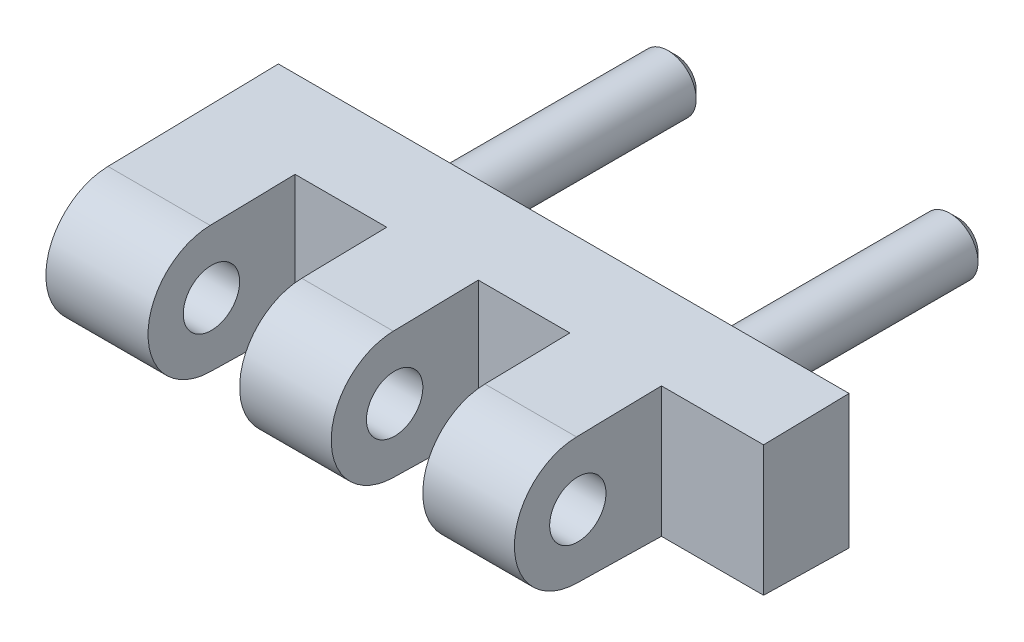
ISO-10303-21;
HEADER;
FILE_DESCRIPTION(('STEP AP214'),'2;1');
FILE_NAME('part.step','',(''),(''),'','','');
FILE_SCHEMA(('AUTOMOTIVE_DESIGN { 1 0 10303 214 1 1 1 1 }'));
ENDSEC;
DATA;
#1=APPLICATION_CONTEXT('core data for automotive mechanical design processes');
#2=APPLICATION_PROTOCOL_DEFINITION('international standard','automotive_design',2000,#1);
#3=PRODUCT_CONTEXT('',#1,'mechanical');
#4=PRODUCT('Part','Part','',(#3));
#5=PRODUCT_RELATED_PRODUCT_CATEGORY('part','',(#4));
#6=PRODUCT_DEFINITION_FORMATION('','',#4);
#7=PRODUCT_DEFINITION_CONTEXT('part definition',#1,'design');
#8=PRODUCT_DEFINITION('design','',#6,#7);
#9=PRODUCT_DEFINITION_SHAPE('','',#8);
#10=(LENGTH_UNIT() NAMED_UNIT(*) SI_UNIT(.MILLI.,.METRE.));
#11=(NAMED_UNIT(*) PLANE_ANGLE_UNIT() SI_UNIT($,.RADIAN.));
#12=(NAMED_UNIT(*) SI_UNIT($,.STERADIAN.) SOLID_ANGLE_UNIT());
#13=UNCERTAINTY_MEASURE_WITH_UNIT(LENGTH_MEASURE(1.E-05),#10,'distance_accuracy_value','');
#14=(GEOMETRIC_REPRESENTATION_CONTEXT(3) GLOBAL_UNCERTAINTY_ASSIGNED_CONTEXT((#13)) GLOBAL_UNIT_ASSIGNED_CONTEXT((#10,
#11,#12)) REPRESENTATION_CONTEXT('',''));
#15=CARTESIAN_POINT('',(0.,0.,0.));
#16=DIRECTION('',(0.,0.,1.));
#17=DIRECTION('',(1.,0.,0.));
#18=AXIS2_PLACEMENT_3D('',#15,#16,#17);
#19=CARTESIAN_POINT('',(30.25,0.,12.));
#20=DIRECTION('',(-1.,0.,0.));
#21=DIRECTION('',(0.,0.,1.));
#22=AXIS2_PLACEMENT_3D('',#19,#20,#21);
#23=CYLINDRICAL_SURFACE('',#22,4.5);
#24=DIRECTION('',(-1.,0.,0.));
#25=VECTOR('',#24,1.);
#26=CARTESIAN_POINT('',(30.25,-4.49903130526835,12.0933665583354));
#27=LINE('',#26,#25);
#28=CARTESIAN_POINT('',(-3.,-4.49903130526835,12.0933665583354));
#29=VERTEX_POINT('',#28);
#30=CARTESIAN_POINT('',(-10.25,-4.49903130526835,12.0933665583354));
#31=VERTEX_POINT('',#30);
#32=EDGE_CURVE('E224',#29,#31,#27,.T.);
#33=ORIENTED_EDGE('',*,*,#32,.F.);
#34=CARTESIAN_POINT('',(-3.,0.,12.));
#35=DIRECTION('',(-1.,0.,0.));
#36=DIRECTION('',(0.,0.,1.));
#37=AXIS2_PLACEMENT_3D('',#34,#35,#36);
#38=CIRCLE('',#37,4.5);
#39=CARTESIAN_POINT('',(-3.,4.49903130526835,12.0933665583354));
#40=VERTEX_POINT('',#39);
#41=EDGE_CURVE('E181',#29,#40,#38,.T.);
#42=ORIENTED_EDGE('',*,*,#41,.T.);
#43=DIRECTION('',(-1.,0.,0.));
#44=VECTOR('',#43,1.);
#45=CARTESIAN_POINT('',(30.25,4.49903130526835,12.0933665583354));
#46=LINE('',#45,#44);
#47=CARTESIAN_POINT('',(-10.25,4.49903130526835,12.0933665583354));
#48=VERTEX_POINT('',#47);
#49=EDGE_CURVE('E228',#40,#48,#46,.T.);
#50=ORIENTED_EDGE('',*,*,#49,.T.);
#51=CARTESIAN_POINT('',(-10.25,0.,12.));
#52=DIRECTION('',(1.,0.,0.));
#53=DIRECTION('',(0.,0.,-1.));
#54=AXIS2_PLACEMENT_3D('',#51,#52,#53);
#55=CIRCLE('',#54,4.5);
#56=EDGE_CURVE('E213',#48,#31,#55,.T.);
#57=ORIENTED_EDGE('',*,*,#56,.T.);
#58=EDGE_LOOP('',(#33,#42,#50,#57));
#59=FACE_BOUND('',#58,.T.);
#60=ADVANCED_FACE('F14',(#59),#23,.T.);
#61=CARTESIAN_POINT('',(10.,4.49903130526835,12.0933665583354));
#62=VERTEX_POINT('',#61);
#63=CARTESIAN_POINT('',(3.5,4.49903130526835,12.0933665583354));
#64=VERTEX_POINT('',#63);
#65=EDGE_CURVE('E230',#62,#64,#46,.T.);
#66=ORIENTED_EDGE('',*,*,#65,.T.);
#67=CARTESIAN_POINT('',(3.5,0.,12.));
#68=DIRECTION('',(1.,0.,0.));
#69=DIRECTION('',(0.,0.,-1.));
#70=AXIS2_PLACEMENT_3D('',#67,#68,#69);
#71=CIRCLE('',#70,4.5);
#72=CARTESIAN_POINT('',(3.5,-4.49903130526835,12.0933665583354));
#73=VERTEX_POINT('',#72);
#74=EDGE_CURVE('E171',#64,#73,#71,.T.);
#75=ORIENTED_EDGE('',*,*,#74,.T.);
#76=CARTESIAN_POINT('',(10.,-4.49903130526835,12.0933665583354));
#77=VERTEX_POINT('',#76);
#78=EDGE_CURVE('E226',#77,#73,#27,.T.);
#79=ORIENTED_EDGE('',*,*,#78,.F.);
#80=CARTESIAN_POINT('',(10.,0.,12.));
#81=DIRECTION('',(-1.,0.,0.));
#82=DIRECTION('',(0.,0.,1.));
#83=AXIS2_PLACEMENT_3D('',#80,#81,#82);
#84=CIRCLE('',#83,4.5);
#85=EDGE_CURVE('E161',#77,#62,#84,.T.);
#86=ORIENTED_EDGE('',*,*,#85,.T.);
#87=EDGE_LOOP('',(#66,#75,#79,#86));
#88=FACE_BOUND('',#87,.T.);
#89=ADVANCED_FACE('F271',(#88),#23,.T.);
#90=CARTESIAN_POINT('',(30.25,0.,12.));
#91=DIRECTION('',(-1.,0.,0.));
#92=DIRECTION('',(0.,0.,1.));
#93=AXIS2_PLACEMENT_3D('',#90,#91,#92);
#94=CYLINDRICAL_SURFACE('',#93,2.);
#95=CARTESIAN_POINT('',(-3.,0.,12.));
#96=DIRECTION('',(-1.,0.,0.));
#97=DIRECTION('',(0.,0.,1.));
#98=AXIS2_PLACEMENT_3D('',#95,#96,#97);
#99=CIRCLE('',#98,2.);
#100=CARTESIAN_POINT('',(-3.,0.,14.));
#101=VERTEX_POINT('',#100);
#102=EDGE_CURVE('E177',#101,#101,#99,.T.);
#103=ORIENTED_EDGE('',*,*,#102,.F.);
#104=EDGE_LOOP('',(#103));
#105=FACE_BOUND('',#104,.T.);
#106=CARTESIAN_POINT('',(-10.25,0.,12.));
#107=DIRECTION('',(1.,0.,0.));
#108=DIRECTION('',(0.,0.,-1.));
#109=AXIS2_PLACEMENT_3D('',#106,#107,#108);
#110=CIRCLE('',#109,2.);
#111=CARTESIAN_POINT('',(-10.25,0.,10.));
#112=VERTEX_POINT('',#111);
#113=EDGE_CURVE('E197',#112,#112,#110,.T.);
#114=ORIENTED_EDGE('',*,*,#113,.F.);
#115=EDGE_LOOP('',(#114));
#116=FACE_BOUND('',#115,.T.);
#117=ADVANCED_FACE('F279',(#105,#116),#94,.F.);
#118=CARTESIAN_POINT('',(30.25,0.,12.));
#119=DIRECTION('',(1.,0.,0.));
#120=DIRECTION('',(0.,0.,-1.));
#121=AXIS2_PLACEMENT_3D('',#118,#119,#120);
#122=PLANE('',#121);
#123=DIRECTION('',(0.,1.,0.));
#124=VECTOR('',#123,1.);
#125=CARTESIAN_POINT('',(30.25,0.,6.06549880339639));
#126=LINE('',#125,#124);
#127=CARTESIAN_POINT('',(30.25,-4.62412518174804,6.06549880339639));
#128=VERTEX_POINT('',#127);
#129=CARTESIAN_POINT('',(30.25,4.62412518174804,6.06549880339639));
#130=VERTEX_POINT('',#129);
#131=EDGE_CURVE('E120',#128,#130,#126,.T.);
#132=ORIENTED_EDGE('',*,*,#131,.F.);
#133=DIRECTION('',(0.,-0.0207481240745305,-0.999784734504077));
#134=VECTOR('',#133,1.);
#135=CARTESIAN_POINT('',(30.25,-4.75,0.));
#136=LINE('',#135,#134);
#137=CARTESIAN_POINT('',(30.25,-4.75,0.));
#138=VERTEX_POINT('',#137);
#139=EDGE_CURVE('E205',#128,#138,#136,.T.);
#140=ORIENTED_EDGE('',*,*,#139,.T.);
#141=DIRECTION('',(0.,1.,0.));
#142=VECTOR('',#141,1.);
#143=CARTESIAN_POINT('',(30.25,4.75,0.));
#144=LINE('',#143,#142);
#145=CARTESIAN_POINT('',(30.25,4.75,0.));
#146=VERTEX_POINT('',#145);
#147=EDGE_CURVE('E208',#138,#146,#144,.T.);
#148=ORIENTED_EDGE('',*,*,#147,.T.);
#149=DIRECTION('',(0.,-0.0207481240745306,0.999784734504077));
#150=VECTOR('',#149,1.);
#151=CARTESIAN_POINT('',(30.25,4.75,0.));
#152=LINE('',#151,#150);
#153=EDGE_CURVE('E203',#146,#130,#152,.T.);
#154=ORIENTED_EDGE('',*,*,#153,.T.);
#155=EDGE_LOOP('',(#132,#140,#148,#154));
#156=FACE_BOUND('',#155,.T.);
#157=ADVANCED_FACE('F345',(#156),#122,.T.);
#158=CARTESIAN_POINT('',(-10.25,0.,12.));
#159=DIRECTION('',(1.,0.,0.));
#160=DIRECTION('',(0.,0.,-1.));
#161=AXIS2_PLACEMENT_3D('',#158,#159,#160);
#162=PLANE('',#161);
#163=DIRECTION('',(0.,-0.0207481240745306,0.999784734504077));
#164=VECTOR('',#163,1.);
#165=CARTESIAN_POINT('',(-10.25,4.75,0.));
#166=LINE('',#165,#164);
#167=CARTESIAN_POINT('',(-10.25,4.75,0.));
#168=VERTEX_POINT('',#167);
#169=EDGE_CURVE('E202',#168,#48,#166,.T.);
#170=ORIENTED_EDGE('',*,*,#169,.F.);
#171=DIRECTION('',(0.,1.,0.));
#172=VECTOR('',#171,1.);
#173=CARTESIAN_POINT('',(-10.25,4.75,0.));
#174=LINE('',#173,#172);
#175=CARTESIAN_POINT('',(-10.25,-4.75,0.));
#176=VERTEX_POINT('',#175);
#177=EDGE_CURVE('E206',#176,#168,#174,.T.);
#178=ORIENTED_EDGE('',*,*,#177,.F.);
#179=DIRECTION('',(0.,-0.0207481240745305,-0.999784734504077));
#180=VECTOR('',#179,1.);
#181=CARTESIAN_POINT('',(-10.25,-4.75,0.));
#182=LINE('',#181,#180);
#183=EDGE_CURVE('E216',#31,#176,#182,.T.);
#184=ORIENTED_EDGE('',*,*,#183,.F.);
#185=ORIENTED_EDGE('',*,*,#56,.F.);
#186=EDGE_LOOP('',(#170,#178,#184,#185));
#187=FACE_BOUND('',#186,.T.);
#188=ORIENTED_EDGE('',*,*,#113,.T.);
#189=EDGE_LOOP('',(#188));
#190=FACE_BOUND('',#189,.T.);
#191=ADVANCED_FACE('F294',(#187,#190),#162,.F.);
#192=CARTESIAN_POINT('',(30.25,4.75,0.));
#193=DIRECTION('',(0.,-0.999784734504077,-0.0207481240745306));
#194=DIRECTION('',(0.,0.0207481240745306,-0.999784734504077));
#195=AXIS2_PLACEMENT_3D('',#192,#193,#194);
#196=PLANE('',#195);
#197=ORIENTED_EDGE('',*,*,#49,.F.);
#198=DIRECTION('',(0.,0.0207481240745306,-0.999784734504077));
#199=VECTOR('',#198,1.);
#200=CARTESIAN_POINT('',(-3.,4.75,0.));
#201=LINE('',#200,#199);
#202=CARTESIAN_POINT('',(-3.,4.62412518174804,6.06549880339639));
#203=VERTEX_POINT('',#202);
#204=EDGE_CURVE('E184',#40,#203,#201,.T.);
#205=ORIENTED_EDGE('',*,*,#204,.T.);
#206=DIRECTION('',(1.,0.,0.));
#207=VECTOR('',#206,1.);
#208=CARTESIAN_POINT('',(30.25,4.62412518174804,6.06549880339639));
#209=LINE('',#208,#207);
#210=CARTESIAN_POINT('',(3.5,4.62412518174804,6.06549880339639));
#211=VERTEX_POINT('',#210);
#212=EDGE_CURVE('E190',#203,#211,#209,.T.);
#213=ORIENTED_EDGE('',*,*,#212,.T.);
#214=DIRECTION('',(0.,-0.0207481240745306,0.999784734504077));
#215=VECTOR('',#214,1.);
#216=CARTESIAN_POINT('',(3.5,4.75,0.));
#217=LINE('',#216,#215);
#218=EDGE_CURVE('E174',#211,#64,#217,.T.);
#219=ORIENTED_EDGE('',*,*,#218,.T.);
#220=ORIENTED_EDGE('',*,*,#65,.F.);
#221=DIRECTION('',(0.,0.0207481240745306,-0.999784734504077));
#222=VECTOR('',#221,1.);
#223=CARTESIAN_POINT('',(10.,4.75,0.));
#224=LINE('',#223,#222);
#225=CARTESIAN_POINT('',(10.,4.62412518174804,6.06549880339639));
#226=VERTEX_POINT('',#225);
#227=EDGE_CURVE('E164',#62,#226,#224,.T.);
#228=ORIENTED_EDGE('',*,*,#227,.T.);
#229=DIRECTION('',(1.,0.,0.));
#230=VECTOR('',#229,1.);
#231=CARTESIAN_POINT('',(30.25,4.62412518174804,6.06549880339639));
#232=LINE('',#231,#230);
#233=CARTESIAN_POINT('',(16.5,4.62412518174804,6.06549880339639));
#234=VERTEX_POINT('',#233);
#235=EDGE_CURVE('E125',#226,#234,#232,.T.);
#236=ORIENTED_EDGE('',*,*,#235,.T.);
#237=DIRECTION('',(0.,-0.0207481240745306,0.999784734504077));
#238=VECTOR('',#237,1.);
#239=CARTESIAN_POINT('',(16.5,4.75,0.));
#240=LINE('',#239,#238);
#241=CARTESIAN_POINT('',(16.5,4.49903130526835,12.0933665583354));
#242=VERTEX_POINT('',#241);
#243=EDGE_CURVE('E155',#234,#242,#240,.T.);
#244=ORIENTED_EDGE('',*,*,#243,.T.);
#245=CARTESIAN_POINT('',(23.,4.49903130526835,12.0933665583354));
#246=VERTEX_POINT('',#245);
#247=EDGE_CURVE('E140',#246,#242,#46,.T.);
#248=ORIENTED_EDGE('',*,*,#247,.F.);
#249=DIRECTION('',(0.,0.0207481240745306,-0.999784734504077));
#250=VECTOR('',#249,1.);
#251=CARTESIAN_POINT('',(23.,4.75,0.));
#252=LINE('',#251,#250);
#253=CARTESIAN_POINT('',(23.,4.62412518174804,6.06549880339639));
#254=VERTEX_POINT('',#253);
#255=EDGE_CURVE('E129',#246,#254,#252,.T.);
#256=ORIENTED_EDGE('',*,*,#255,.T.);
#257=DIRECTION('',(1.,0.,0.));
#258=VECTOR('',#257,1.);
#259=CARTESIAN_POINT('',(30.25,4.62412518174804,6.06549880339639));
#260=LINE('',#259,#258);
#261=EDGE_CURVE('E114',#254,#130,#260,.T.);
#262=ORIENTED_EDGE('',*,*,#261,.T.);
#263=ORIENTED_EDGE('',*,*,#153,.F.);
#264=DIRECTION('',(-1.,0.,0.));
#265=VECTOR('',#264,1.);
#266=CARTESIAN_POINT('',(30.25,4.75,0.));
#267=LINE('',#266,#265);
#268=EDGE_CURVE('E210',#146,#168,#267,.T.);
#269=ORIENTED_EDGE('',*,*,#268,.T.);
#270=ORIENTED_EDGE('',*,*,#169,.T.);
#271=EDGE_LOOP('',(#197,#205,#213,#219,#220,#228,#236,#244,#248,#256,#262,#263,#269,#270));
#272=FACE_BOUND('',#271,.T.);
#273=ADVANCED_FACE('F137',(#272),#196,.F.);
#274=ORIENTED_EDGE('',*,*,#247,.T.);
#275=CARTESIAN_POINT('',(16.5,0.,12.));
#276=DIRECTION('',(1.,0.,0.));
#277=DIRECTION('',(0.,0.,-1.));
#278=AXIS2_PLACEMENT_3D('',#275,#276,#277);
#279=CIRCLE('',#278,4.5);
#280=CARTESIAN_POINT('',(16.5,-4.49903130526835,12.0933665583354));
#281=VERTEX_POINT('',#280);
#282=EDGE_CURVE('E152',#242,#281,#279,.T.);
#283=ORIENTED_EDGE('',*,*,#282,.T.);
#284=CARTESIAN_POINT('',(23.,-4.49903130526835,12.0933665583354));
#285=VERTEX_POINT('',#284);
#286=EDGE_CURVE('E227',#285,#281,#27,.T.);
#287=ORIENTED_EDGE('',*,*,#286,.F.);
#288=CARTESIAN_POINT('',(23.,0.,12.));
#289=DIRECTION('',(-1.,0.,0.));
#290=DIRECTION('',(0.,0.,1.));
#291=AXIS2_PLACEMENT_3D('',#288,#289,#290);
#292=CIRCLE('',#291,4.5);
#293=EDGE_CURVE('E142',#285,#246,#292,.T.);
#294=ORIENTED_EDGE('',*,*,#293,.T.);
#295=EDGE_LOOP('',(#274,#283,#287,#294));
#296=FACE_BOUND('',#295,.T.);
#297=ADVANCED_FACE('F274',(#296),#23,.T.);
#298=CARTESIAN_POINT('',(30.25,-4.75,0.));
#299=DIRECTION('',(0.,0.999784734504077,-0.0207481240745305));
#300=DIRECTION('',(0.,0.0207481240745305,0.999784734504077));
#301=AXIS2_PLACEMENT_3D('',#298,#299,#300);
#302=PLANE('',#301);
#303=DIRECTION('',(-1.,0.,0.));
#304=VECTOR('',#303,1.);
#305=CARTESIAN_POINT('',(30.25,-4.62412518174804,6.06549880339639));
#306=LINE('',#305,#304);
#307=CARTESIAN_POINT('',(3.5,-4.62412518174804,6.06549880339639));
#308=VERTEX_POINT('',#307);
#309=CARTESIAN_POINT('',(-3.,-4.62412518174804,6.06549880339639));
#310=VERTEX_POINT('',#309);
#311=EDGE_CURVE('E246',#308,#310,#306,.T.);
#312=ORIENTED_EDGE('',*,*,#311,.T.);
#313=DIRECTION('',(0.,0.0207481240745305,0.999784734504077));
#314=VECTOR('',#313,1.);
#315=CARTESIAN_POINT('',(-3.,-4.75,0.));
#316=LINE('',#315,#314);
#317=EDGE_CURVE('E178',#310,#29,#316,.T.);
#318=ORIENTED_EDGE('',*,*,#317,.T.);
#319=ORIENTED_EDGE('',*,*,#32,.T.);
#320=ORIENTED_EDGE('',*,*,#183,.T.);
#321=DIRECTION('',(-1.,0.,0.));
#322=VECTOR('',#321,1.);
#323=CARTESIAN_POINT('',(30.25,-4.75,0.));
#324=LINE('',#323,#322);
#325=EDGE_CURVE('E221',#138,#176,#324,.T.);
#326=ORIENTED_EDGE('',*,*,#325,.F.);
#327=ORIENTED_EDGE('',*,*,#139,.F.);
#328=DIRECTION('',(-1.,0.,0.));
#329=VECTOR('',#328,1.);
#330=CARTESIAN_POINT('',(30.25,-4.62412518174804,6.06549880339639));
#331=LINE('',#330,#329);
#332=CARTESIAN_POINT('',(23.,-4.62412518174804,6.06549880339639));
#333=VERTEX_POINT('',#332);
#334=EDGE_CURVE('E241',#128,#333,#331,.T.);
#335=ORIENTED_EDGE('',*,*,#334,.T.);
#336=DIRECTION('',(0.,0.0207481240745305,0.999784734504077));
#337=VECTOR('',#336,1.);
#338=CARTESIAN_POINT('',(23.,-4.75,0.));
#339=LINE('',#338,#337);
#340=EDGE_CURVE('E132',#333,#285,#339,.T.);
#341=ORIENTED_EDGE('',*,*,#340,.T.);
#342=ORIENTED_EDGE('',*,*,#286,.T.);
#343=DIRECTION('',(0.,-0.0207481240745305,-0.999784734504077));
#344=VECTOR('',#343,1.);
#345=CARTESIAN_POINT('',(16.5,-4.75,0.));
#346=LINE('',#345,#344);
#347=CARTESIAN_POINT('',(16.5,-4.62412518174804,6.06549880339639));
#348=VERTEX_POINT('',#347);
#349=EDGE_CURVE('E145',#281,#348,#346,.T.);
#350=ORIENTED_EDGE('',*,*,#349,.T.);
#351=DIRECTION('',(-1.,0.,0.));
#352=VECTOR('',#351,1.);
#353=CARTESIAN_POINT('',(30.25,-4.62412518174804,6.06549880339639));
#354=LINE('',#353,#352);
#355=CARTESIAN_POINT('',(10.,-4.62412518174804,6.06549880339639));
#356=VERTEX_POINT('',#355);
#357=EDGE_CURVE('E243',#348,#356,#354,.T.);
#358=ORIENTED_EDGE('',*,*,#357,.T.);
#359=DIRECTION('',(0.,0.0207481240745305,0.999784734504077));
#360=VECTOR('',#359,1.);
#361=CARTESIAN_POINT('',(10.,-4.75,0.));
#362=LINE('',#361,#360);
#363=EDGE_CURVE('E158',#356,#77,#362,.T.);
#364=ORIENTED_EDGE('',*,*,#363,.T.);
#365=ORIENTED_EDGE('',*,*,#78,.T.);
#366=DIRECTION('',(0.,-0.0207481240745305,-0.999784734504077));
#367=VECTOR('',#366,1.);
#368=CARTESIAN_POINT('',(3.5,-4.75,0.));
#369=LINE('',#368,#367);
#370=EDGE_CURVE('E168',#73,#308,#369,.T.);
#371=ORIENTED_EDGE('',*,*,#370,.T.);
#372=EDGE_LOOP('',(#312,#318,#319,#320,#326,#327,#335,#341,#342,#350,#358,#364,#365,#371));
#373=FACE_BOUND('',#372,.T.);
#374=ADVANCED_FACE('F285',(#373),#302,.F.);
#375=CARTESIAN_POINT('',(30.25,4.75,0.));
#376=DIRECTION('',(0.,0.,1.));
#377=DIRECTION('',(0.,-1.,0.));
#378=AXIS2_PLACEMENT_3D('',#375,#376,#377);
#379=PLANE('',#378);
#380=CARTESIAN_POINT('',(20.,0.,0.));
#381=DIRECTION('',(0.,0.,-1.));
#382=DIRECTION('',(0.,1.,0.));
#383=AXIS2_PLACEMENT_3D('',#380,#381,#382);
#384=CIRCLE('',#383,2.);
#385=CARTESIAN_POINT('',(20.,2.,0.));
#386=VERTEX_POINT('',#385);
#387=EDGE_CURVE('E194',#386,#386,#384,.T.);
#388=ORIENTED_EDGE('',*,*,#387,.F.);
#389=EDGE_LOOP('',(#388));
#390=FACE_BOUND('',#389,.T.);
#391=CARTESIAN_POINT('',(0.,0.,0.));
#392=DIRECTION('',(0.,0.,-1.));
#393=DIRECTION('',(0.,1.,0.));
#394=AXIS2_PLACEMENT_3D('',#391,#392,#393);
#395=CIRCLE('',#394,2.);
#396=CARTESIAN_POINT('',(0.,2.,0.));
#397=VERTEX_POINT('',#396);
#398=EDGE_CURVE('E193',#397,#397,#395,.T.);
#399=ORIENTED_EDGE('',*,*,#398,.F.);
#400=EDGE_LOOP('',(#399));
#401=FACE_BOUND('',#400,.T.);
#402=ORIENTED_EDGE('',*,*,#177,.T.);
#403=ORIENTED_EDGE('',*,*,#268,.F.);
#404=ORIENTED_EDGE('',*,*,#147,.F.);
#405=ORIENTED_EDGE('',*,*,#325,.T.);
#406=EDGE_LOOP('',(#402,#403,#404,#405));
#407=FACE_BOUND('',#406,.T.);
#408=ADVANCED_FACE('F292',(#390,#401,#407),#379,.F.);
#409=CARTESIAN_POINT('',(23.,-7.75,18.8364288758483));
#410=DIRECTION('',(-1.,0.,0.));
#411=DIRECTION('',(0.,0.,1.));
#412=AXIS2_PLACEMENT_3D('',#409,#410,#411);
#413=PLANE('',#412);
#414=CARTESIAN_POINT('',(23.,0.,12.));
#415=DIRECTION('',(-1.,0.,0.));
#416=DIRECTION('',(0.,0.,1.));
#417=AXIS2_PLACEMENT_3D('',#414,#415,#416);
#418=CIRCLE('',#417,2.);
#419=CARTESIAN_POINT('',(23.,0.,14.));
#420=VERTEX_POINT('',#419);
#421=EDGE_CURVE('E231',#420,#420,#418,.T.);
#422=ORIENTED_EDGE('',*,*,#421,.T.);
#423=EDGE_LOOP('',(#422));
#424=FACE_BOUND('',#423,.T.);
#425=ORIENTED_EDGE('',*,*,#293,.F.);
#426=ORIENTED_EDGE('',*,*,#340,.F.);
#427=DIRECTION('',(0.,1.,0.));
#428=VECTOR('',#427,1.);
#429=CARTESIAN_POINT('',(23.,-7.75,6.06549880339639));
#430=LINE('',#429,#428);
#431=EDGE_CURVE('E117',#333,#254,#430,.T.);
#432=ORIENTED_EDGE('',*,*,#431,.T.);
#433=ORIENTED_EDGE('',*,*,#255,.F.);
#434=EDGE_LOOP('',(#425,#426,#432,#433));
#435=FACE_BOUND('',#434,.T.);
#436=ADVANCED_FACE('F128',(#424,#435),#413,.F.);
#437=CARTESIAN_POINT('',(23.,-7.75,6.06549880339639));
#438=DIRECTION('',(0.,0.,-1.));
#439=DIRECTION('',(-1.,0.,0.));
#440=AXIS2_PLACEMENT_3D('',#437,#438,#439);
#441=PLANE('',#440);
#442=ORIENTED_EDGE('',*,*,#431,.F.);
#443=ORIENTED_EDGE('',*,*,#334,.F.);
#444=ORIENTED_EDGE('',*,*,#131,.T.);
#445=ORIENTED_EDGE('',*,*,#261,.F.);
#446=EDGE_LOOP('',(#442,#443,#444,#445));
#447=FACE_BOUND('',#446,.T.);
#448=ADVANCED_FACE('F116',(#447),#441,.F.);
#449=CARTESIAN_POINT('',(16.5,-7.75,6.06549880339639));
#450=DIRECTION('',(1.,0.,0.));
#451=DIRECTION('',(0.,0.,-1.));
#452=AXIS2_PLACEMENT_3D('',#449,#450,#451);
#453=PLANE('',#452);
#454=CARTESIAN_POINT('',(16.5,0.,12.));
#455=DIRECTION('',(1.,0.,0.));
#456=DIRECTION('',(0.,0.,-1.));
#457=AXIS2_PLACEMENT_3D('',#454,#455,#456);
#458=CIRCLE('',#457,2.);
#459=CARTESIAN_POINT('',(16.5,0.,10.));
#460=VERTEX_POINT('',#459);
#461=EDGE_CURVE('E141',#460,#460,#458,.T.);
#462=ORIENTED_EDGE('',*,*,#461,.T.);
#463=EDGE_LOOP('',(#462));
#464=FACE_BOUND('',#463,.T.);
#465=DIRECTION('',(0.,1.,0.));
#466=VECTOR('',#465,1.);
#467=CARTESIAN_POINT('',(16.5,-7.75,6.06549880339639));
#468=LINE('',#467,#466);
#469=EDGE_CURVE('E37',#348,#234,#468,.T.);
#470=ORIENTED_EDGE('',*,*,#469,.F.);
#471=ORIENTED_EDGE('',*,*,#349,.F.);
#472=ORIENTED_EDGE('',*,*,#282,.F.);
#473=ORIENTED_EDGE('',*,*,#243,.F.);
#474=EDGE_LOOP('',(#470,#471,#472,#473));
#475=FACE_BOUND('',#474,.T.);
#476=ADVANCED_FACE('F318',(#464,#475),#453,.F.);
#477=CARTESIAN_POINT('',(10.,-7.75,6.06549880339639));
#478=DIRECTION('',(-1.,0.,0.));
#479=DIRECTION('',(0.,0.,1.));
#480=AXIS2_PLACEMENT_3D('',#477,#478,#479);
#481=PLANE('',#480);
#482=CARTESIAN_POINT('',(10.,0.,12.));
#483=DIRECTION('',(-1.,0.,0.));
#484=DIRECTION('',(0.,0.,1.));
#485=AXIS2_PLACEMENT_3D('',#482,#483,#484);
#486=CIRCLE('',#485,2.);
#487=CARTESIAN_POINT('',(10.,0.,14.));
#488=VERTEX_POINT('',#487);
#489=EDGE_CURVE('E157',#488,#488,#486,.T.);
#490=ORIENTED_EDGE('',*,*,#489,.T.);
#491=EDGE_LOOP('',(#490));
#492=FACE_BOUND('',#491,.T.);
#493=ORIENTED_EDGE('',*,*,#85,.F.);
#494=ORIENTED_EDGE('',*,*,#363,.F.);
#495=DIRECTION('',(0.,1.,0.));
#496=VECTOR('',#495,1.);
#497=CARTESIAN_POINT('',(10.,-7.75,6.06549880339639));
#498=LINE('',#497,#496);
#499=EDGE_CURVE('E306',#356,#226,#498,.T.);
#500=ORIENTED_EDGE('',*,*,#499,.T.);
#501=ORIENTED_EDGE('',*,*,#227,.F.);
#502=EDGE_LOOP('',(#493,#494,#500,#501));
#503=FACE_BOUND('',#502,.T.);
#504=ADVANCED_FACE('F315',(#492,#503),#481,.F.);
#505=CARTESIAN_POINT('',(10.,-7.75,6.06549880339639));
#506=DIRECTION('',(0.,0.,-1.));
#507=DIRECTION('',(-1.,0.,0.));
#508=AXIS2_PLACEMENT_3D('',#505,#506,#507);
#509=PLANE('',#508);
#510=ORIENTED_EDGE('',*,*,#499,.F.);
#511=ORIENTED_EDGE('',*,*,#357,.F.);
#512=ORIENTED_EDGE('',*,*,#469,.T.);
#513=ORIENTED_EDGE('',*,*,#235,.F.);
#514=EDGE_LOOP('',(#510,#511,#512,#513));
#515=FACE_BOUND('',#514,.T.);
#516=ADVANCED_FACE('F317',(#515),#509,.F.);
#517=CARTESIAN_POINT('',(3.5,0.,12.));
#518=DIRECTION('',(1.,0.,0.));
#519=DIRECTION('',(0.,0.,-1.));
#520=AXIS2_PLACEMENT_3D('',#517,#518,#519);
#521=CIRCLE('',#520,2.);
#522=CARTESIAN_POINT('',(3.5,0.,10.));
#523=VERTEX_POINT('',#522);
#524=EDGE_CURVE('E167',#523,#523,#521,.T.);
#525=ORIENTED_EDGE('',*,*,#524,.F.);
#526=EDGE_LOOP('',(#525));
#527=FACE_BOUND('',#526,.T.);
#528=ORIENTED_EDGE('',*,*,#489,.F.);
#529=EDGE_LOOP('',(#528));
#530=FACE_BOUND('',#529,.T.);
#531=ADVANCED_FACE('F344',(#527,#530),#94,.F.);
#532=CARTESIAN_POINT('',(-3.,-7.75,6.06549880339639));
#533=DIRECTION('',(0.,0.,-1.));
#534=DIRECTION('',(-1.,0.,0.));
#535=AXIS2_PLACEMENT_3D('',#532,#533,#534);
#536=PLANE('',#535);
#537=DIRECTION('',(0.,1.,0.));
#538=VECTOR('',#537,1.);
#539=CARTESIAN_POINT('',(-3.,-7.75,6.06549880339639));
#540=LINE('',#539,#538);
#541=EDGE_CURVE('E233',#310,#203,#540,.T.);
#542=ORIENTED_EDGE('',*,*,#541,.F.);
#543=ORIENTED_EDGE('',*,*,#311,.F.);
#544=DIRECTION('',(0.,1.,0.));
#545=VECTOR('',#544,1.);
#546=CARTESIAN_POINT('',(3.5,-7.75,6.06549880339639));
#547=LINE('',#546,#545);
#548=EDGE_CURVE('E29',#308,#211,#547,.T.);
#549=ORIENTED_EDGE('',*,*,#548,.T.);
#550=ORIENTED_EDGE('',*,*,#212,.F.);
#551=EDGE_LOOP('',(#542,#543,#549,#550));
#552=FACE_BOUND('',#551,.T.);
#553=ADVANCED_FACE('F304',(#552),#536,.F.);
#554=CARTESIAN_POINT('',(-3.,-7.75,22.6004924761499));
#555=DIRECTION('',(-1.,0.,0.));
#556=DIRECTION('',(0.,0.,1.));
#557=AXIS2_PLACEMENT_3D('',#554,#555,#556);
#558=PLANE('',#557);
#559=ORIENTED_EDGE('',*,*,#102,.T.);
#560=EDGE_LOOP('',(#559));
#561=FACE_BOUND('',#560,.T.);
#562=ORIENTED_EDGE('',*,*,#41,.F.);
#563=ORIENTED_EDGE('',*,*,#317,.F.);
#564=ORIENTED_EDGE('',*,*,#541,.T.);
#565=ORIENTED_EDGE('',*,*,#204,.F.);
#566=EDGE_LOOP('',(#562,#563,#564,#565));
#567=FACE_BOUND('',#566,.T.);
#568=ADVANCED_FACE('F335',(#561,#567),#558,.F.);
#569=CARTESIAN_POINT('',(3.5,-7.75,6.06549880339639));
#570=DIRECTION('',(1.,0.,0.));
#571=DIRECTION('',(0.,0.,-1.));
#572=AXIS2_PLACEMENT_3D('',#569,#570,#571);
#573=PLANE('',#572);
#574=ORIENTED_EDGE('',*,*,#524,.T.);
#575=EDGE_LOOP('',(#574));
#576=FACE_BOUND('',#575,.T.);
#577=ORIENTED_EDGE('',*,*,#548,.F.);
#578=ORIENTED_EDGE('',*,*,#370,.F.);
#579=ORIENTED_EDGE('',*,*,#74,.F.);
#580=ORIENTED_EDGE('',*,*,#218,.F.);
#581=EDGE_LOOP('',(#577,#578,#579,#580));
#582=FACE_BOUND('',#581,.T.);
#583=ADVANCED_FACE('F301',(#576,#582),#573,.F.);
#584=ORIENTED_EDGE('',*,*,#461,.F.);
#585=EDGE_LOOP('',(#584));
#586=FACE_BOUND('',#585,.T.);
#587=ORIENTED_EDGE('',*,*,#421,.F.);
#588=EDGE_LOOP('',(#587));
#589=FACE_BOUND('',#588,.T.);
#590=ADVANCED_FACE('F339',(#586,#589),#94,.F.);
#591=CARTESIAN_POINT('',(0.,0.,-18.));
#592=DIRECTION('',(0.,0.,1.));
#593=DIRECTION('',(0.,-1.,0.));
#594=AXIS2_PLACEMENT_3D('',#591,#592,#593);
#595=CYLINDRICAL_SURFACE('',#594,2.);
#596=CARTESIAN_POINT('',(0.,0.,-17.4));
#597=DIRECTION('',(0.,0.,-1.));
#598=DIRECTION('',(0.,1.,0.));
#599=AXIS2_PLACEMENT_3D('',#596,#597,#598);
#600=CIRCLE('',#599,2.);
#601=CARTESIAN_POINT('',(0.,2.,-17.4));
#602=VERTEX_POINT('',#601);
#603=EDGE_CURVE('E9',#602,#602,#600,.F.);
#604=ORIENTED_EDGE('',*,*,#603,.T.);
#605=EDGE_LOOP('',(#604));
#606=FACE_BOUND('',#605,.T.);
#607=ORIENTED_EDGE('',*,*,#398,.T.);
#608=EDGE_LOOP('',(#607));
#609=FACE_BOUND('',#608,.T.);
#610=ADVANCED_FACE('F342',(#606,#609),#595,.T.);
#611=CARTESIAN_POINT('',(0.,0.,-18.));
#612=DIRECTION('',(0.,0.,-1.));
#613=DIRECTION('',(0.,1.,0.));
#614=AXIS2_PLACEMENT_3D('',#611,#612,#613);
#615=PLANE('',#614);
#616=CARTESIAN_POINT('',(0.,0.,-18.));
#617=DIRECTION('',(0.,0.,-1.));
#618=DIRECTION('',(0.,1.,0.));
#619=AXIS2_PLACEMENT_3D('',#616,#617,#618);
#620=CIRCLE('',#619,1.4);
#621=CARTESIAN_POINT('',(0.,1.4,-18.));
#622=VERTEX_POINT('',#621);
#623=EDGE_CURVE('E22',#622,#622,#620,.T.);
#624=ORIENTED_EDGE('',*,*,#623,.T.);
#625=EDGE_LOOP('',(#624));
#626=FACE_BOUND('',#625,.T.);
#627=ADVANCED_FACE('F257',(#626),#615,.T.);
#628=CARTESIAN_POINT('',(20.,0.,-18.));
#629=DIRECTION('',(0.,0.,1.));
#630=DIRECTION('',(0.,-1.,0.));
#631=AXIS2_PLACEMENT_3D('',#628,#629,#630);
#632=CYLINDRICAL_SURFACE('',#631,2.);
#633=CARTESIAN_POINT('',(20.,0.,-17.4));
#634=DIRECTION('',(0.,0.,-1.));
#635=DIRECTION('',(0.,1.,0.));
#636=AXIS2_PLACEMENT_3D('',#633,#634,#635);
#637=CIRCLE('',#636,2.);
#638=CARTESIAN_POINT('',(20.,2.,-17.4));
#639=VERTEX_POINT('',#638);
#640=EDGE_CURVE('E252',#639,#639,#637,.F.);
#641=ORIENTED_EDGE('',*,*,#640,.T.);
#642=EDGE_LOOP('',(#641));
#643=FACE_BOUND('',#642,.T.);
#644=ORIENTED_EDGE('',*,*,#387,.T.);
#645=EDGE_LOOP('',(#644));
#646=FACE_BOUND('',#645,.T.);
#647=ADVANCED_FACE('F401',(#643,#646),#632,.T.);
#648=CARTESIAN_POINT('',(20.,0.,-18.));
#649=DIRECTION('',(0.,0.,-1.));
#650=DIRECTION('',(0.,1.,0.));
#651=AXIS2_PLACEMENT_3D('',#648,#649,#650);
#652=PLANE('',#651);
#653=CARTESIAN_POINT('',(20.,0.,-18.));
#654=DIRECTION('',(0.,0.,-1.));
#655=DIRECTION('',(0.,1.,0.));
#656=AXIS2_PLACEMENT_3D('',#653,#654,#655);
#657=CIRCLE('',#656,1.4);
#658=CARTESIAN_POINT('',(20.,1.4,-18.));
#659=VERTEX_POINT('',#658);
#660=EDGE_CURVE('E249',#659,#659,#657,.T.);
#661=ORIENTED_EDGE('',*,*,#660,.T.);
#662=EDGE_LOOP('',(#661));
#663=FACE_BOUND('',#662,.T.);
#664=ADVANCED_FACE('F267',(#663),#652,.T.);
#665=CARTESIAN_POINT('',(20.,0.,-18.));
#666=DIRECTION('',(0.,0.,1.));
#667=DIRECTION('',(0.,-1.,0.));
#668=AXIS2_PLACEMENT_3D('',#665,#666,#667);
#669=CONICAL_SURFACE('',#668,1.4,0.785398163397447);
#670=ORIENTED_EDGE('',*,*,#640,.F.);
#671=EDGE_LOOP('',(#670));
#672=FACE_BOUND('',#671,.T.);
#673=ORIENTED_EDGE('',*,*,#660,.F.);
#674=EDGE_LOOP('',(#673));
#675=FACE_BOUND('',#674,.T.);
#676=ADVANCED_FACE('F260',(#672,#675),#669,.T.);
#677=CARTESIAN_POINT('',(0.,0.,-18.));
#678=DIRECTION('',(0.,0.,1.));
#679=DIRECTION('',(0.,-1.,0.));
#680=AXIS2_PLACEMENT_3D('',#677,#678,#679);
#681=CONICAL_SURFACE('',#680,1.4,0.785398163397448);
#682=ORIENTED_EDGE('',*,*,#603,.F.);
#683=EDGE_LOOP('',(#682));
#684=FACE_BOUND('',#683,.T.);
#685=ORIENTED_EDGE('',*,*,#623,.F.);
#686=EDGE_LOOP('',(#685));
#687=FACE_BOUND('',#686,.T.);
#688=ADVANCED_FACE('F16',(#684,#687),#681,.T.);
#689=CLOSED_SHELL('',(#60,#89,#117,#157,#191,#273,#297,#374,#408,#436,#448,#476,#504,#516,#531,
#553,#568,#583,#590,#610,#627,#647,#664,#676,#688));
#690=MANIFOLD_SOLID_BREP('B1',#689);
#691=ADVANCED_BREP_SHAPE_REPRESENTATION('',(#18,#690),#14);
#692=SHAPE_DEFINITION_REPRESENTATION(#9,#691);
ENDSEC;
END-ISO-10303-21;
